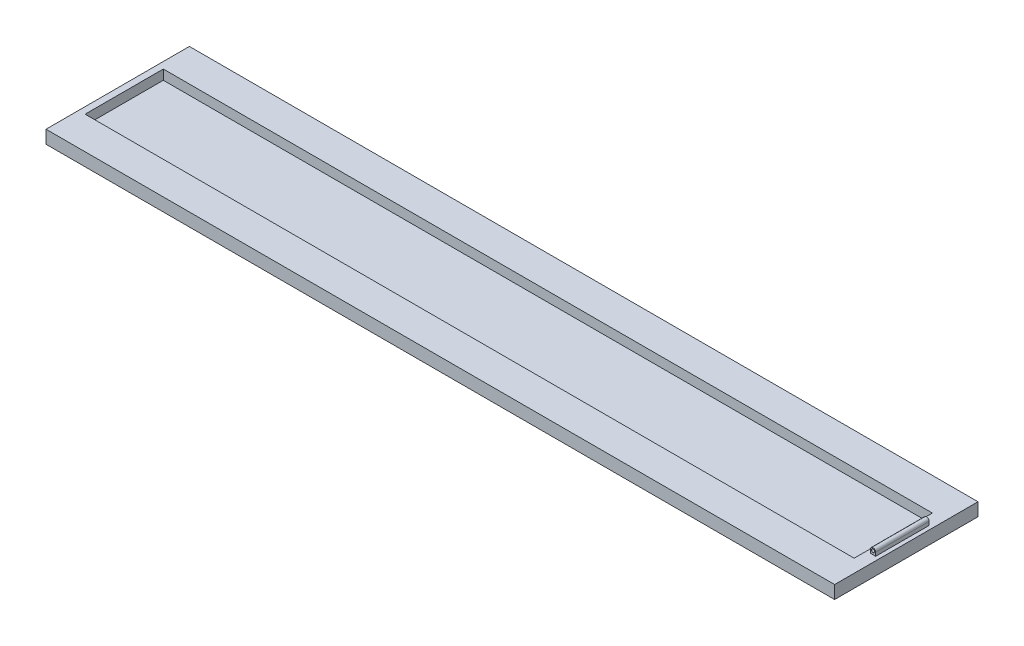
ISO-10303-21;
HEADER;
FILE_DESCRIPTION(('STEP AP214'),'2;1');
FILE_NAME('part.step','',(''),(''),'','','');
FILE_SCHEMA(('AUTOMOTIVE_DESIGN { 1 0 10303 214 1 1 1 1 }'));
ENDSEC;
DATA;
#1=APPLICATION_CONTEXT('core data for automotive mechanical design processes');
#2=APPLICATION_PROTOCOL_DEFINITION('international standard','automotive_design',2000,#1);
#3=PRODUCT_CONTEXT('',#1,'mechanical');
#4=PRODUCT('Part','Part','',(#3));
#5=PRODUCT_RELATED_PRODUCT_CATEGORY('part','',(#4));
#6=PRODUCT_DEFINITION_FORMATION('','',#4);
#7=PRODUCT_DEFINITION_CONTEXT('part definition',#1,'design');
#8=PRODUCT_DEFINITION('design','',#6,#7);
#9=PRODUCT_DEFINITION_SHAPE('','',#8);
#10=(LENGTH_UNIT() NAMED_UNIT(*) SI_UNIT(.MILLI.,.METRE.));
#11=(NAMED_UNIT(*) PLANE_ANGLE_UNIT() SI_UNIT($,.RADIAN.));
#12=(NAMED_UNIT(*) SI_UNIT($,.STERADIAN.) SOLID_ANGLE_UNIT());
#13=UNCERTAINTY_MEASURE_WITH_UNIT(LENGTH_MEASURE(1.E-05),#10,'distance_accuracy_value','');
#14=(GEOMETRIC_REPRESENTATION_CONTEXT(3) GLOBAL_UNCERTAINTY_ASSIGNED_CONTEXT((#13)) GLOBAL_UNIT_ASSIGNED_CONTEXT((#10,
#11,#12)) REPRESENTATION_CONTEXT('',''));
#15=CARTESIAN_POINT('',(0.,0.,0.));
#16=DIRECTION('',(0.,0.,1.));
#17=DIRECTION('',(1.,0.,0.));
#18=AXIS2_PLACEMENT_3D('',#15,#16,#17);
#19=CARTESIAN_POINT('',(-12000.,-55.,1100.));
#20=DIRECTION('',(0.,-1.,0.));
#21=DIRECTION('',(0.,0.,-1.));
#22=AXIS2_PLACEMENT_3D('',#19,#20,#21);
#23=PLANE('',#22);
#24=DIRECTION('',(1.,0.,0.));
#25=VECTOR('',#24,1.);
#26=CARTESIAN_POINT('',(-11900.,-55.,600.));
#27=LINE('',#26,#25);
#28=CARTESIAN_POINT('',(-11900.,-55.,600.));
#29=VERTEX_POINT('',#28);
#30=CARTESIAN_POINT('',(-99.9999999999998,-55.,600.));
#31=VERTEX_POINT('',#30);
#32=EDGE_CURVE('E149',#29,#31,#27,.T.);
#33=ORIENTED_EDGE('',*,*,#32,.F.);
#34=DIRECTION('',(0.,0.,1.));
#35=VECTOR('',#34,1.);
#36=CARTESIAN_POINT('',(-11900.,-55.,-600.));
#37=LINE('',#36,#35);
#38=CARTESIAN_POINT('',(-11900.,-55.,-600.));
#39=VERTEX_POINT('',#38);
#40=EDGE_CURVE('E46',#39,#29,#37,.T.);
#41=ORIENTED_EDGE('',*,*,#40,.F.);
#42=DIRECTION('',(-1.,0.,0.));
#43=VECTOR('',#42,1.);
#44=CARTESIAN_POINT('',(-11900.,-55.,-600.));
#45=LINE('',#44,#43);
#46=CARTESIAN_POINT('',(-100.,-55.,-600.));
#47=VERTEX_POINT('',#46);
#48=EDGE_CURVE('E140',#47,#39,#45,.T.);
#49=ORIENTED_EDGE('',*,*,#48,.F.);
#50=DIRECTION('',(0.,0.,-1.));
#51=VECTOR('',#50,1.);
#52=CARTESIAN_POINT('',(-100.,-55.,-600.));
#53=LINE('',#52,#51);
#54=EDGE_CURVE('E143',#31,#47,#53,.T.);
#55=ORIENTED_EDGE('',*,*,#54,.F.);
#56=EDGE_LOOP('',(#33,#41,#49,#55));
#57=FACE_BOUND('',#56,.T.);
#58=DIRECTION('',(-1.,0.,0.));
#59=VECTOR('',#58,1.);
#60=CARTESIAN_POINT('',(-12000.,-55.,-1100.));
#61=LINE('',#60,#59);
#62=CARTESIAN_POINT('',(100.,-55.,-1100.));
#63=VERTEX_POINT('',#62);
#64=CARTESIAN_POINT('',(-12000.,-55.,-1100.));
#65=VERTEX_POINT('',#64);
#66=EDGE_CURVE('E198',#63,#65,#61,.T.);
#67=ORIENTED_EDGE('',*,*,#66,.T.);
#68=DIRECTION('',(0.,0.,-1.));
#69=VECTOR('',#68,1.);
#70=CARTESIAN_POINT('',(-12000.,-55.,1100.));
#71=LINE('',#70,#69);
#72=CARTESIAN_POINT('',(-12000.,-55.,1100.));
#73=VERTEX_POINT('',#72);
#74=EDGE_CURVE('E204',#73,#65,#71,.T.);
#75=ORIENTED_EDGE('',*,*,#74,.F.);
#76=DIRECTION('',(-1.,0.,0.));
#77=VECTOR('',#76,1.);
#78=CARTESIAN_POINT('',(-12000.,-55.,1100.));
#79=LINE('',#78,#77);
#80=CARTESIAN_POINT('',(100.,-55.,1100.));
#81=VERTEX_POINT('',#80);
#82=EDGE_CURVE('E202',#81,#73,#79,.T.);
#83=ORIENTED_EDGE('',*,*,#82,.F.);
#84=DIRECTION('',(0.,0.,-1.));
#85=VECTOR('',#84,1.);
#86=CARTESIAN_POINT('',(100.,-55.,1100.));
#87=LINE('',#86,#85);
#88=EDGE_CURVE('E214',#81,#63,#87,.T.);
#89=ORIENTED_EDGE('',*,*,#88,.T.);
#90=EDGE_LOOP('',(#67,#75,#83,#89));
#91=FACE_BOUND('',#90,.T.);
#92=DIRECTION('',(0.,0.,-1.));
#93=VECTOR('',#92,1.);
#94=CARTESIAN_POINT('',(-40.,-55.,410.));
#95=LINE('',#94,#93);
#96=CARTESIAN_POINT('',(-39.9999999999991,-55.,410.));
#97=VERTEX_POINT('',#96);
#98=CARTESIAN_POINT('',(-39.9999999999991,-55.,-410.));
#99=VERTEX_POINT('',#98);
#100=EDGE_CURVE('E188',#97,#99,#95,.T.);
#101=ORIENTED_EDGE('',*,*,#100,.T.);
#102=DIRECTION('',(1.,0.,0.));
#103=VECTOR('',#102,1.);
#104=CARTESIAN_POINT('',(-40.,-55.,-410.));
#105=LINE('',#104,#103);
#106=CARTESIAN_POINT('',(40.,-55.,-410.));
#107=VERTEX_POINT('',#106);
#108=EDGE_CURVE('E180',#99,#107,#105,.T.);
#109=ORIENTED_EDGE('',*,*,#108,.T.);
#110=DIRECTION('',(0.,0.,-1.));
#111=VECTOR('',#110,1.);
#112=CARTESIAN_POINT('',(40.,-55.,410.));
#113=LINE('',#112,#111);
#114=CARTESIAN_POINT('',(39.9999999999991,-55.,410.));
#115=VERTEX_POINT('',#114);
#116=EDGE_CURVE('E185',#115,#107,#113,.T.);
#117=ORIENTED_EDGE('',*,*,#116,.F.);
#118=DIRECTION('',(1.,0.,0.));
#119=VECTOR('',#118,1.);
#120=CARTESIAN_POINT('',(-40.,-55.,410.));
#121=LINE('',#120,#119);
#122=EDGE_CURVE('E54',#97,#115,#121,.T.);
#123=ORIENTED_EDGE('',*,*,#122,.F.);
#124=EDGE_LOOP('',(#101,#109,#117,#123));
#125=FACE_BOUND('',#124,.T.);
#126=ADVANCED_FACE('F31',(#57,#91,#125),#23,.F.);
#127=CARTESIAN_POINT('',(-12000.,-55.,1100.));
#128=DIRECTION('',(1.,0.,0.));
#129=DIRECTION('',(0.,0.,-1.));
#130=AXIS2_PLACEMENT_3D('',#127,#128,#129);
#131=PLANE('',#130);
#132=DIRECTION('',(0.,-1.,0.));
#133=VECTOR('',#132,1.);
#134=CARTESIAN_POINT('',(-12000.,-55.,-1100.));
#135=LINE('',#134,#133);
#136=CARTESIAN_POINT('',(-12000.,-255.,-1100.));
#137=VERTEX_POINT('',#136);
#138=EDGE_CURVE('E193',#65,#137,#135,.T.);
#139=ORIENTED_EDGE('',*,*,#138,.T.);
#140=DIRECTION('',(0.,0.,-1.));
#141=VECTOR('',#140,1.);
#142=CARTESIAN_POINT('',(-12000.,-255.,1100.));
#143=LINE('',#142,#141);
#144=CARTESIAN_POINT('',(-12000.,-255.,1100.));
#145=VERTEX_POINT('',#144);
#146=EDGE_CURVE('E11',#145,#137,#143,.T.);
#147=ORIENTED_EDGE('',*,*,#146,.F.);
#148=DIRECTION('',(0.,-1.,0.));
#149=VECTOR('',#148,1.);
#150=CARTESIAN_POINT('',(-12000.,-55.,1100.));
#151=LINE('',#150,#149);
#152=EDGE_CURVE('E194',#73,#145,#151,.T.);
#153=ORIENTED_EDGE('',*,*,#152,.F.);
#154=ORIENTED_EDGE('',*,*,#74,.T.);
#155=EDGE_LOOP('',(#139,#147,#153,#154));
#156=FACE_BOUND('',#155,.T.);
#157=ADVANCED_FACE('F33',(#156),#131,.F.);
#158=CARTESIAN_POINT('',(-12000.,-255.,1100.));
#159=DIRECTION('',(0.,1.,0.));
#160=DIRECTION('',(0.,0.,1.));
#161=AXIS2_PLACEMENT_3D('',#158,#159,#160);
#162=PLANE('',#161);
#163=DIRECTION('',(1.,0.,0.));
#164=VECTOR('',#163,1.);
#165=CARTESIAN_POINT('',(-12000.,-255.,-1100.));
#166=LINE('',#165,#164);
#167=CARTESIAN_POINT('',(100.,-255.,-1100.));
#168=VERTEX_POINT('',#167);
#169=EDGE_CURVE('E207',#137,#168,#166,.T.);
#170=ORIENTED_EDGE('',*,*,#169,.T.);
#171=DIRECTION('',(0.,0.,-1.));
#172=VECTOR('',#171,1.);
#173=CARTESIAN_POINT('',(100.,-255.,1100.));
#174=LINE('',#173,#172);
#175=CARTESIAN_POINT('',(100.,-255.,1100.));
#176=VERTEX_POINT('',#175);
#177=EDGE_CURVE('E39',#176,#168,#174,.T.);
#178=ORIENTED_EDGE('',*,*,#177,.F.);
#179=DIRECTION('',(1.,0.,0.));
#180=VECTOR('',#179,1.);
#181=CARTESIAN_POINT('',(-12000.,-255.,1100.));
#182=LINE('',#181,#180);
#183=EDGE_CURVE('E197',#145,#176,#182,.T.);
#184=ORIENTED_EDGE('',*,*,#183,.F.);
#185=ORIENTED_EDGE('',*,*,#146,.T.);
#186=EDGE_LOOP('',(#170,#178,#184,#185));
#187=FACE_BOUND('',#186,.T.);
#188=ADVANCED_FACE('F236',(#187),#162,.F.);
#189=CARTESIAN_POINT('',(100.,-55.,1100.));
#190=DIRECTION('',(-1.,0.,0.));
#191=DIRECTION('',(0.,-1.,0.));
#192=AXIS2_PLACEMENT_3D('',#189,#190,#191);
#193=PLANE('',#192);
#194=DIRECTION('',(0.,1.,0.));
#195=VECTOR('',#194,1.);
#196=CARTESIAN_POINT('',(100.,-55.,-1100.));
#197=LINE('',#196,#195);
#198=EDGE_CURVE('E209',#168,#63,#197,.T.);
#199=ORIENTED_EDGE('',*,*,#198,.T.);
#200=ORIENTED_EDGE('',*,*,#88,.F.);
#201=DIRECTION('',(0.,1.,0.));
#202=VECTOR('',#201,1.);
#203=CARTESIAN_POINT('',(100.,-55.,1100.));
#204=LINE('',#203,#202);
#205=EDGE_CURVE('E200',#176,#81,#204,.T.);
#206=ORIENTED_EDGE('',*,*,#205,.F.);
#207=ORIENTED_EDGE('',*,*,#177,.T.);
#208=EDGE_LOOP('',(#199,#200,#206,#207));
#209=FACE_BOUND('',#208,.T.);
#210=ADVANCED_FACE('F221',(#209),#193,.F.);
#211=CARTESIAN_POINT('',(-12000.,-255.,1100.));
#212=DIRECTION('',(0.,0.,1.));
#213=DIRECTION('',(1.,0.,0.));
#214=AXIS2_PLACEMENT_3D('',#211,#212,#213);
#215=PLANE('',#214);
#216=ORIENTED_EDGE('',*,*,#152,.T.);
#217=ORIENTED_EDGE('',*,*,#183,.T.);
#218=ORIENTED_EDGE('',*,*,#205,.T.);
#219=ORIENTED_EDGE('',*,*,#82,.T.);
#220=EDGE_LOOP('',(#216,#217,#218,#219));
#221=FACE_BOUND('',#220,.T.);
#222=ADVANCED_FACE('F235',(#221),#215,.T.);
#223=CARTESIAN_POINT('',(-12000.,-255.,-1100.));
#224=DIRECTION('',(0.,0.,1.));
#225=DIRECTION('',(1.,0.,0.));
#226=AXIS2_PLACEMENT_3D('',#223,#224,#225);
#227=PLANE('',#226);
#228=ORIENTED_EDGE('',*,*,#138,.F.);
#229=ORIENTED_EDGE('',*,*,#66,.F.);
#230=ORIENTED_EDGE('',*,*,#198,.F.);
#231=ORIENTED_EDGE('',*,*,#169,.F.);
#232=EDGE_LOOP('',(#228,#229,#230,#231));
#233=FACE_BOUND('',#232,.T.);
#234=ADVANCED_FACE('F227',(#233),#227,.F.);
#235=CARTESIAN_POINT('',(0.,0.,410.));
#236=DIRECTION('',(0.,0.,1.));
#237=DIRECTION('',(1.,0.,0.));
#238=AXIS2_PLACEMENT_3D('',#235,#236,#237);
#239=PLANE('',#238);
#240=CARTESIAN_POINT('',(0.,0.,410.));
#241=DIRECTION('',(0.,0.,1.));
#242=DIRECTION('',(1.,0.,0.));
#243=AXIS2_PLACEMENT_3D('',#240,#241,#242);
#244=CIRCLE('',#243,40.);
#245=CARTESIAN_POINT('',(40.,0.,410.));
#246=VERTEX_POINT('',#245);
#247=CARTESIAN_POINT('',(-40.,0.,410.));
#248=VERTEX_POINT('',#247);
#249=EDGE_CURVE('E165',#246,#248,#244,.T.);
#250=ORIENTED_EDGE('',*,*,#249,.T.);
#251=DIRECTION('',(0.,-1.,0.));
#252=VECTOR('',#251,1.);
#253=CARTESIAN_POINT('',(-40.,0.,410.));
#254=LINE('',#253,#252);
#255=EDGE_CURVE('E168',#248,#97,#254,.T.);
#256=ORIENTED_EDGE('',*,*,#255,.T.);
#257=ORIENTED_EDGE('',*,*,#122,.T.);
#258=DIRECTION('',(0.,1.,0.));
#259=VECTOR('',#258,1.);
#260=CARTESIAN_POINT('',(40.,-55.,410.));
#261=LINE('',#260,#259);
#262=EDGE_CURVE('E172',#115,#246,#261,.T.);
#263=ORIENTED_EDGE('',*,*,#262,.T.);
#264=EDGE_LOOP('',(#250,#256,#257,#263));
#265=FACE_BOUND('',#264,.T.);
#266=CARTESIAN_POINT('',(0.,0.,410.));
#267=DIRECTION('',(0.,0.,1.));
#268=DIRECTION('',(1.,0.,0.));
#269=AXIS2_PLACEMENT_3D('',#266,#267,#268);
#270=CIRCLE('',#269,25.);
#271=CARTESIAN_POINT('',(-25.,0.,410.));
#272=VERTEX_POINT('',#271);
#273=EDGE_CURVE('E159',#272,#272,#270,.T.);
#274=ORIENTED_EDGE('',*,*,#273,.F.);
#275=EDGE_LOOP('',(#274));
#276=FACE_BOUND('',#275,.T.);
#277=ADVANCED_FACE('F251',(#265,#276),#239,.T.);
#278=CARTESIAN_POINT('',(0.,0.,-410.));
#279=DIRECTION('',(0.,0.,1.));
#280=DIRECTION('',(1.,0.,0.));
#281=AXIS2_PLACEMENT_3D('',#278,#279,#280);
#282=PLANE('',#281);
#283=CARTESIAN_POINT('',(0.,0.,-410.));
#284=DIRECTION('',(0.,0.,1.));
#285=DIRECTION('',(1.,0.,0.));
#286=AXIS2_PLACEMENT_3D('',#283,#284,#285);
#287=CIRCLE('',#286,40.);
#288=CARTESIAN_POINT('',(40.,0.,-410.));
#289=VERTEX_POINT('',#288);
#290=CARTESIAN_POINT('',(-40.,0.,-410.));
#291=VERTEX_POINT('',#290);
#292=EDGE_CURVE('E162',#289,#291,#287,.T.);
#293=ORIENTED_EDGE('',*,*,#292,.F.);
#294=DIRECTION('',(0.,1.,0.));
#295=VECTOR('',#294,1.);
#296=CARTESIAN_POINT('',(40.,-55.,-410.));
#297=LINE('',#296,#295);
#298=EDGE_CURVE('E169',#107,#289,#297,.T.);
#299=ORIENTED_EDGE('',*,*,#298,.F.);
#300=ORIENTED_EDGE('',*,*,#108,.F.);
#301=DIRECTION('',(0.,-1.,0.));
#302=VECTOR('',#301,1.);
#303=CARTESIAN_POINT('',(-40.,0.,-410.));
#304=LINE('',#303,#302);
#305=EDGE_CURVE('E177',#291,#99,#304,.T.);
#306=ORIENTED_EDGE('',*,*,#305,.F.);
#307=EDGE_LOOP('',(#293,#299,#300,#306));
#308=FACE_BOUND('',#307,.T.);
#309=CARTESIAN_POINT('',(0.,0.,-410.));
#310=DIRECTION('',(0.,0.,1.));
#311=DIRECTION('',(1.,0.,0.));
#312=AXIS2_PLACEMENT_3D('',#309,#310,#311);
#313=CIRCLE('',#312,25.);
#314=CARTESIAN_POINT('',(-25.,0.,-410.));
#315=VERTEX_POINT('',#314);
#316=EDGE_CURVE('E155',#315,#315,#313,.T.);
#317=ORIENTED_EDGE('',*,*,#316,.T.);
#318=EDGE_LOOP('',(#317));
#319=FACE_BOUND('',#318,.T.);
#320=ADVANCED_FACE('F258',(#308,#319),#282,.F.);
#321=CARTESIAN_POINT('',(0.,0.,410.));
#322=DIRECTION('',(0.,0.,-1.));
#323=DIRECTION('',(-1.,0.,0.));
#324=AXIS2_PLACEMENT_3D('',#321,#322,#323);
#325=CYLINDRICAL_SURFACE('',#324,40.);
#326=ORIENTED_EDGE('',*,*,#292,.T.);
#327=DIRECTION('',(0.,0.,-1.));
#328=VECTOR('',#327,1.);
#329=CARTESIAN_POINT('',(-40.,0.,410.));
#330=LINE('',#329,#328);
#331=EDGE_CURVE('E190',#248,#291,#330,.T.);
#332=ORIENTED_EDGE('',*,*,#331,.F.);
#333=ORIENTED_EDGE('',*,*,#249,.F.);
#334=DIRECTION('',(0.,0.,-1.));
#335=VECTOR('',#334,1.);
#336=CARTESIAN_POINT('',(40.,0.,410.));
#337=LINE('',#336,#335);
#338=EDGE_CURVE('E174',#246,#289,#337,.T.);
#339=ORIENTED_EDGE('',*,*,#338,.T.);
#340=EDGE_LOOP('',(#326,#332,#333,#339));
#341=FACE_BOUND('',#340,.T.);
#342=ADVANCED_FACE('F254',(#341),#325,.T.);
#343=CARTESIAN_POINT('',(-40.,0.,410.));
#344=DIRECTION('',(1.,0.,0.));
#345=DIRECTION('',(0.,1.,0.));
#346=AXIS2_PLACEMENT_3D('',#343,#344,#345);
#347=PLANE('',#346);
#348=ORIENTED_EDGE('',*,*,#305,.T.);
#349=ORIENTED_EDGE('',*,*,#100,.F.);
#350=ORIENTED_EDGE('',*,*,#255,.F.);
#351=ORIENTED_EDGE('',*,*,#331,.T.);
#352=EDGE_LOOP('',(#348,#349,#350,#351));
#353=FACE_BOUND('',#352,.T.);
#354=ADVANCED_FACE('F257',(#353),#347,.F.);
#355=CARTESIAN_POINT('',(40.,-55.,410.));
#356=DIRECTION('',(-1.,0.,0.));
#357=DIRECTION('',(0.,-1.,0.));
#358=AXIS2_PLACEMENT_3D('',#355,#356,#357);
#359=PLANE('',#358);
#360=ORIENTED_EDGE('',*,*,#298,.T.);
#361=ORIENTED_EDGE('',*,*,#338,.F.);
#362=ORIENTED_EDGE('',*,*,#262,.F.);
#363=ORIENTED_EDGE('',*,*,#116,.T.);
#364=EDGE_LOOP('',(#360,#361,#362,#363));
#365=FACE_BOUND('',#364,.T.);
#366=ADVANCED_FACE('F262',(#365),#359,.F.);
#367=CARTESIAN_POINT('',(0.,0.,410.));
#368=DIRECTION('',(0.,0.,-1.));
#369=DIRECTION('',(-1.,0.,0.));
#370=AXIS2_PLACEMENT_3D('',#367,#368,#369);
#371=CYLINDRICAL_SURFACE('',#370,25.);
#372=CARTESIAN_POINT('',(-25.,0.,410.));
#373=CARTESIAN_POINT('',(-25.,0.,401.458333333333));
#374=CARTESIAN_POINT('',(-25.,0.,392.916666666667));
#375=CARTESIAN_POINT('',(-25.,0.,375.833333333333));
#376=CARTESIAN_POINT('',(-25.,0.,367.291666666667));
#377=CARTESIAN_POINT('',(-25.,0.,350.208333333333));
#378=CARTESIAN_POINT('',(-25.,0.,341.666666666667));
#379=CARTESIAN_POINT('',(-25.,0.,324.583333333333));
#380=CARTESIAN_POINT('',(-25.,0.,316.041666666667));
#381=CARTESIAN_POINT('',(-25.,0.,298.958333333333));
#382=CARTESIAN_POINT('',(-25.,0.,290.416666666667));
#383=CARTESIAN_POINT('',(-25.,0.,273.333333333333));
#384=CARTESIAN_POINT('',(-25.,0.,264.791666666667));
#385=CARTESIAN_POINT('',(-25.,0.,247.708333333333));
#386=CARTESIAN_POINT('',(-25.,0.,239.166666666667));
#387=CARTESIAN_POINT('',(-25.,0.,222.083333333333));
#388=CARTESIAN_POINT('',(-25.,0.,213.541666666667));
#389=CARTESIAN_POINT('',(-25.,0.,196.458333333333));
#390=CARTESIAN_POINT('',(-25.,0.,187.916666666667));
#391=CARTESIAN_POINT('',(-25.,0.,170.833333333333));
#392=CARTESIAN_POINT('',(-25.,0.,162.291666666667));
#393=CARTESIAN_POINT('',(-25.,0.,145.208333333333));
#394=CARTESIAN_POINT('',(-25.,0.,136.666666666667));
#395=CARTESIAN_POINT('',(-25.,0.,119.583333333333));
#396=CARTESIAN_POINT('',(-25.,0.,111.041666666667));
#397=CARTESIAN_POINT('',(-25.,0.,93.9583333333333));
#398=CARTESIAN_POINT('',(-25.,0.,85.4166666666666));
#399=CARTESIAN_POINT('',(-25.,0.,68.3333333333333));
#400=CARTESIAN_POINT('',(-25.,0.,59.7916666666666));
#401=CARTESIAN_POINT('',(-25.,0.,42.7083333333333));
#402=CARTESIAN_POINT('',(-25.,0.,34.1666666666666));
#403=CARTESIAN_POINT('',(-25.,0.,17.0833333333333));
#404=CARTESIAN_POINT('',(-25.,0.,8.54166666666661));
#405=CARTESIAN_POINT('',(-25.,0.,-8.54166666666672));
#406=CARTESIAN_POINT('',(-25.,0.,-17.0833333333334));
#407=CARTESIAN_POINT('',(-25.,0.,-34.1666666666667));
#408=CARTESIAN_POINT('',(-25.,0.,-42.7083333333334));
#409=CARTESIAN_POINT('',(-25.,0.,-59.7916666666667));
#410=CARTESIAN_POINT('',(-25.,0.,-68.3333333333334));
#411=CARTESIAN_POINT('',(-25.,0.,-85.4166666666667));
#412=CARTESIAN_POINT('',(-25.,0.,-93.9583333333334));
#413=CARTESIAN_POINT('',(-25.,0.,-111.041666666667));
#414=CARTESIAN_POINT('',(-25.,0.,-119.583333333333));
#415=CARTESIAN_POINT('',(-25.,0.,-136.666666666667));
#416=CARTESIAN_POINT('',(-25.,0.,-145.208333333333));
#417=CARTESIAN_POINT('',(-25.,0.,-162.291666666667));
#418=CARTESIAN_POINT('',(-25.,0.,-170.833333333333));
#419=CARTESIAN_POINT('',(-25.,0.,-187.916666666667));
#420=CARTESIAN_POINT('',(-25.,0.,-196.458333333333));
#421=CARTESIAN_POINT('',(-25.,0.,-213.541666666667));
#422=CARTESIAN_POINT('',(-25.,0.,-222.083333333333));
#423=CARTESIAN_POINT('',(-25.,0.,-239.166666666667));
#424=CARTESIAN_POINT('',(-25.,0.,-247.708333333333));
#425=CARTESIAN_POINT('',(-25.,0.,-264.791666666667));
#426=CARTESIAN_POINT('',(-25.,0.,-273.333333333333));
#427=CARTESIAN_POINT('',(-25.,0.,-290.416666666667));
#428=CARTESIAN_POINT('',(-25.,0.,-298.958333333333));
#429=CARTESIAN_POINT('',(-25.,0.,-316.041666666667));
#430=CARTESIAN_POINT('',(-25.,0.,-324.583333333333));
#431=CARTESIAN_POINT('',(-25.,0.,-341.666666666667));
#432=CARTESIAN_POINT('',(-25.,0.,-350.208333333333));
#433=CARTESIAN_POINT('',(-25.,0.,-367.291666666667));
#434=CARTESIAN_POINT('',(-25.,0.,-375.833333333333));
#435=CARTESIAN_POINT('',(-25.,0.,-392.916666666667));
#436=CARTESIAN_POINT('',(-25.,0.,-401.458333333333));
#437=CARTESIAN_POINT('',(-25.,0.,-410.));
#438=B_SPLINE_CURVE_WITH_KNOTS('',3,(#372,#373,#374,#375,#376,#377,#378,#379,#380,#381,#382,
#383,#384,#385,#386,#387,#388,#389,#390,#391,#392,#393,#394,#395,#396,#397,#398,#399,#400,#401,
#402,#403,#404,#405,#406,#407,#408,#409,#410,#411,#412,#413,#414,#415,#416,#417,#418,#419,#420,
#421,#422,#423,#424,#425,#426,#427,#428,#429,#430,#431,#432,#433,#434,#435,#436,#437),
.UNSPECIFIED.,.F.,.F.,(4,2,2,2,2,2,2,2,2,2,2,2,2,2,2,2,2,2,2,2,2,2,2,2,2,2,2,2,2,2,2,2,4),(0.,
25.625,51.25,76.875,102.5,128.125,153.75,179.375,205.,230.625,256.25,281.875,307.5,333.125,
358.75,384.375,410.,435.625,461.25,486.875,512.5,538.125,563.75,589.375,615.,640.625,666.25,
691.875,717.5,743.125,768.75,794.375,820.),.UNSPECIFIED.);
#439=EDGE_CURVE('BSEAM266',#272,#315,#438,.T.);
#440=ORIENTED_EDGE('',*,*,#273,.T.);
#441=ORIENTED_EDGE('',*,*,#316,.F.);
#442=ORIENTED_EDGE('',*,*,#439,.T.);
#443=ORIENTED_EDGE('',*,*,#439,.F.);
#444=EDGE_LOOP('',(#440,#442,#441,#443));
#445=FACE_BOUND('',#444,.T.);
#446=ADVANCED_FACE('F266',(#445),#371,.F.);
#447=CARTESIAN_POINT('',(-11900.,-205.,-600.));
#448=DIRECTION('',(-1.,0.,0.));
#449=DIRECTION('',(0.,0.,1.));
#450=AXIS2_PLACEMENT_3D('',#447,#448,#449);
#451=PLANE('',#450);
#452=ORIENTED_EDGE('',*,*,#40,.T.);
#453=DIRECTION('',(0.,1.,0.));
#454=VECTOR('',#453,1.);
#455=CARTESIAN_POINT('',(-11900.,-205.,600.));
#456=LINE('',#455,#454);
#457=CARTESIAN_POINT('',(-11900.,-205.,600.));
#458=VERTEX_POINT('',#457);
#459=EDGE_CURVE('E118',#458,#29,#456,.T.);
#460=ORIENTED_EDGE('',*,*,#459,.F.);
#461=DIRECTION('',(0.,0.,1.));
#462=VECTOR('',#461,1.);
#463=CARTESIAN_POINT('',(-11900.,-205.,-600.));
#464=LINE('',#463,#462);
#465=CARTESIAN_POINT('',(-11900.,-205.,-600.));
#466=VERTEX_POINT('',#465);
#467=EDGE_CURVE('E122',#466,#458,#464,.T.);
#468=ORIENTED_EDGE('',*,*,#467,.F.);
#469=DIRECTION('',(0.,1.,0.));
#470=VECTOR('',#469,1.);
#471=CARTESIAN_POINT('',(-11900.,-205.,-600.));
#472=LINE('',#471,#470);
#473=EDGE_CURVE('E153',#466,#39,#472,.T.);
#474=ORIENTED_EDGE('',*,*,#473,.T.);
#475=EDGE_LOOP('',(#452,#460,#468,#474));
#476=FACE_BOUND('',#475,.T.);
#477=ADVANCED_FACE('F120',(#476),#451,.F.);
#478=CARTESIAN_POINT('',(-11900.,-205.,-600.));
#479=DIRECTION('',(0.,0.,-1.));
#480=DIRECTION('',(-1.,0.,0.));
#481=AXIS2_PLACEMENT_3D('',#478,#479,#480);
#482=PLANE('',#481);
#483=ORIENTED_EDGE('',*,*,#48,.T.);
#484=ORIENTED_EDGE('',*,*,#473,.F.);
#485=DIRECTION('',(-1.,0.,0.));
#486=VECTOR('',#485,1.);
#487=CARTESIAN_POINT('',(-11900.,-205.,-600.));
#488=LINE('',#487,#486);
#489=CARTESIAN_POINT('',(-100.,-205.,-600.));
#490=VERTEX_POINT('',#489);
#491=EDGE_CURVE('E128',#490,#466,#488,.T.);
#492=ORIENTED_EDGE('',*,*,#491,.F.);
#493=DIRECTION('',(0.,1.,0.));
#494=VECTOR('',#493,1.);
#495=CARTESIAN_POINT('',(-100.,-205.,-600.));
#496=LINE('',#495,#494);
#497=EDGE_CURVE('E156',#490,#47,#496,.T.);
#498=ORIENTED_EDGE('',*,*,#497,.T.);
#499=EDGE_LOOP('',(#483,#484,#492,#498));
#500=FACE_BOUND('',#499,.T.);
#501=ADVANCED_FACE('F279',(#500),#482,.F.);
#502=CARTESIAN_POINT('',(-100.,-205.,-600.));
#503=DIRECTION('',(1.,0.,0.));
#504=DIRECTION('',(0.,0.,-1.));
#505=AXIS2_PLACEMENT_3D('',#502,#503,#504);
#506=PLANE('',#505);
#507=ORIENTED_EDGE('',*,*,#54,.T.);
#508=ORIENTED_EDGE('',*,*,#497,.F.);
#509=DIRECTION('',(0.,0.,-1.));
#510=VECTOR('',#509,1.);
#511=CARTESIAN_POINT('',(-100.,-205.,-600.));
#512=LINE('',#511,#510);
#513=CARTESIAN_POINT('',(-99.9999999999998,-205.,600.));
#514=VERTEX_POINT('',#513);
#515=EDGE_CURVE('E136',#514,#490,#512,.T.);
#516=ORIENTED_EDGE('',*,*,#515,.F.);
#517=DIRECTION('',(0.,1.,0.));
#518=VECTOR('',#517,1.);
#519=CARTESIAN_POINT('',(-99.9999999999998,-205.,600.));
#520=LINE('',#519,#518);
#521=EDGE_CURVE('E127',#514,#31,#520,.T.);
#522=ORIENTED_EDGE('',*,*,#521,.T.);
#523=EDGE_LOOP('',(#507,#508,#516,#522));
#524=FACE_BOUND('',#523,.T.);
#525=ADVANCED_FACE('F282',(#524),#506,.F.);
#526=CARTESIAN_POINT('',(-11900.,-205.,600.));
#527=DIRECTION('',(0.,0.,1.));
#528=DIRECTION('',(1.,0.,0.));
#529=AXIS2_PLACEMENT_3D('',#526,#527,#528);
#530=PLANE('',#529);
#531=ORIENTED_EDGE('',*,*,#32,.T.);
#532=ORIENTED_EDGE('',*,*,#521,.F.);
#533=DIRECTION('',(1.,0.,0.));
#534=VECTOR('',#533,1.);
#535=CARTESIAN_POINT('',(-11900.,-205.,600.));
#536=LINE('',#535,#534);
#537=EDGE_CURVE('E131',#458,#514,#536,.T.);
#538=ORIENTED_EDGE('',*,*,#537,.F.);
#539=ORIENTED_EDGE('',*,*,#459,.T.);
#540=EDGE_LOOP('',(#531,#532,#538,#539));
#541=FACE_BOUND('',#540,.T.);
#542=ADVANCED_FACE('F132',(#541),#530,.F.);
#543=CARTESIAN_POINT('',(-11900.,-205.,600.));
#544=DIRECTION('',(0.,1.,0.));
#545=DIRECTION('',(0.,0.,1.));
#546=AXIS2_PLACEMENT_3D('',#543,#544,#545);
#547=PLANE('',#546);
#548=ORIENTED_EDGE('',*,*,#467,.T.);
#549=ORIENTED_EDGE('',*,*,#537,.T.);
#550=ORIENTED_EDGE('',*,*,#515,.T.);
#551=ORIENTED_EDGE('',*,*,#491,.T.);
#552=EDGE_LOOP('',(#548,#549,#550,#551));
#553=FACE_BOUND('',#552,.T.);
#554=ADVANCED_FACE('F138',(#553),#547,.T.);
#555=CLOSED_SHELL('',(#126,#157,#188,#210,#222,#234,#277,#320,#342,#354,#366,#446,#477,#501,
#525,#542,#554));
#556=MANIFOLD_SOLID_BREP('B2',#555);
#557=ADVANCED_BREP_SHAPE_REPRESENTATION('',(#18,#556),#14);
#558=SHAPE_DEFINITION_REPRESENTATION(#9,#557);
ENDSEC;
END-ISO-10303-21;
